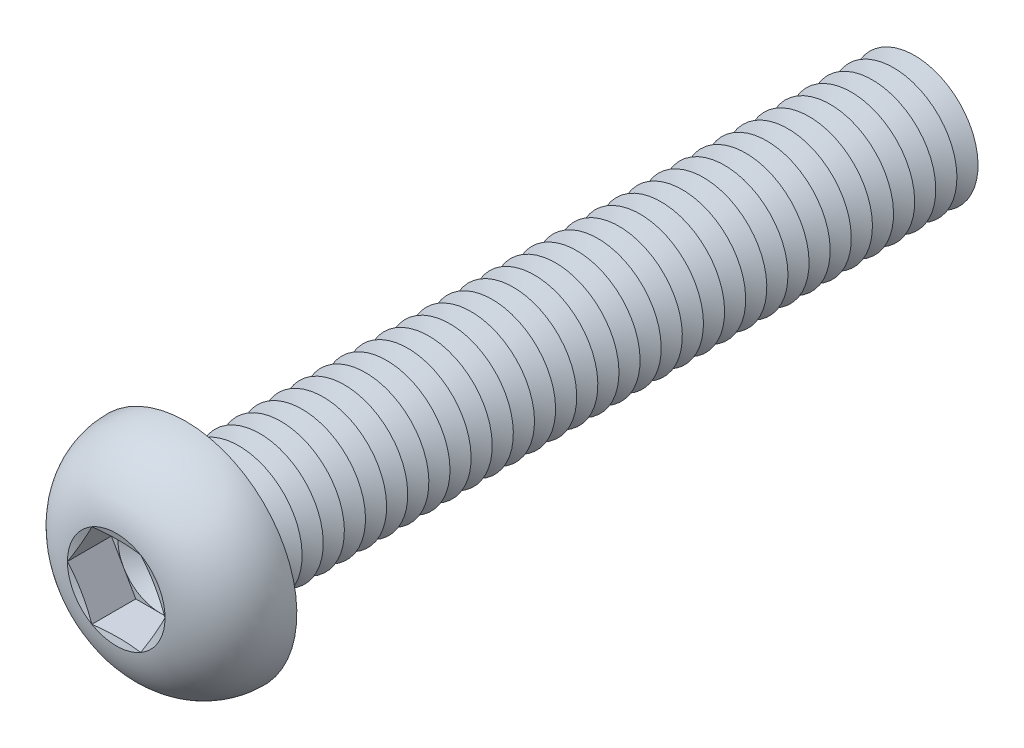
from build123d import *

# Parameters (mm, degrees)
FILLET1_R          = 0.5
LPATTERN1_COUNT    = 35
LPATTERN1_PITCH    = 1
CUT_EXTRUDE1_DEPTH = 2.08


with BuildPart() as part:
    # Sketch1 → Revolve1 (revolve)
    with BuildSketch(Plane(origin=(0, 0, 0), x_dir=(0, 0, -1), z_dir=(1, 0, 0))):
        with BuildLine():
            Line((0, 3), (0, 5.25))
            ThreePointArc((0, 5.25), (-2.210041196, 4.408189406), (-3.3, 2.3094))
            Line((-3.3, 2.3094), (-2.990599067, 1.1547))
            Line((-2.990599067, 1.1547), (-3.3, 1.1547))
            Line((-3.3, 1.1547), (-3.3, 0))
            Line((-3.3, 0), (35, 0))
            Line((35, 0), (35, 3))
            Line((35, 3), (0, 3))
        make_face()
    revolve(axis=Axis((0, 0, -35), (0, 0, 1)))

    # Fillet1
    fillet1_edges = [part.edges().sort_by_distance(p)[0] for p in [
        (0, -3, 0),
    ]]
    fillet(fillet1_edges, radius=FILLET1_R)

    # Sketch2 → Cut-Revolve1 (revolve, cut)
    with BuildSketch(Plane(origin=(0, 0, 0), x_dir=(0, 0, -1), z_dir=(1, 0, 0))):
        Polygon((34.5, 3), (35.5, 3), (35, 2.133974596), align=None)
    cut_revolve1 = revolve(axis=Axis((0, 0, -35), (0, 0, -1)), mode=Mode.SUBTRACT)

    # LPattern1: Cut-Revolve1 ×35
    with Locations(*[(0, 0, i * LPATTERN1_PITCH) for i in range(1, LPATTERN1_COUNT)]):
        add(cut_revolve1, mode=Mode.SUBTRACT)

    # Sketch3 → Cut-Extrude1 (cut)
    with BuildSketch(Plane.XY.offset(3.3)):
        Polygon((1.1547, 1.999999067), (-1.1547, 1.999999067), (-2.3094, 0), (-1.1547, -1.999999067), (1.1547, -1.999999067), (2.3094, 0), align=None)
    extrude(amount=-CUT_EXTRUDE1_DEPTH, mode=Mode.SUBTRACT)

    # Cut-Extrude2 cone 1 section (on through the dimple's axis) → Cut-Extrude2 (revolve, cut)
    with BuildSketch(Plane(origin=(0, 0, 1.22), x_dir=(0, -1, 0), z_dir=(1, 0, 0))):
        Polygon((0, 0), (1.999999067, 0), (0, 1.1547), align=None)
    revolve(axis=Axis((0, 0, 1.22), (0, 0, -1)), mode=Mode.SUBTRACT)


solid = part.part
